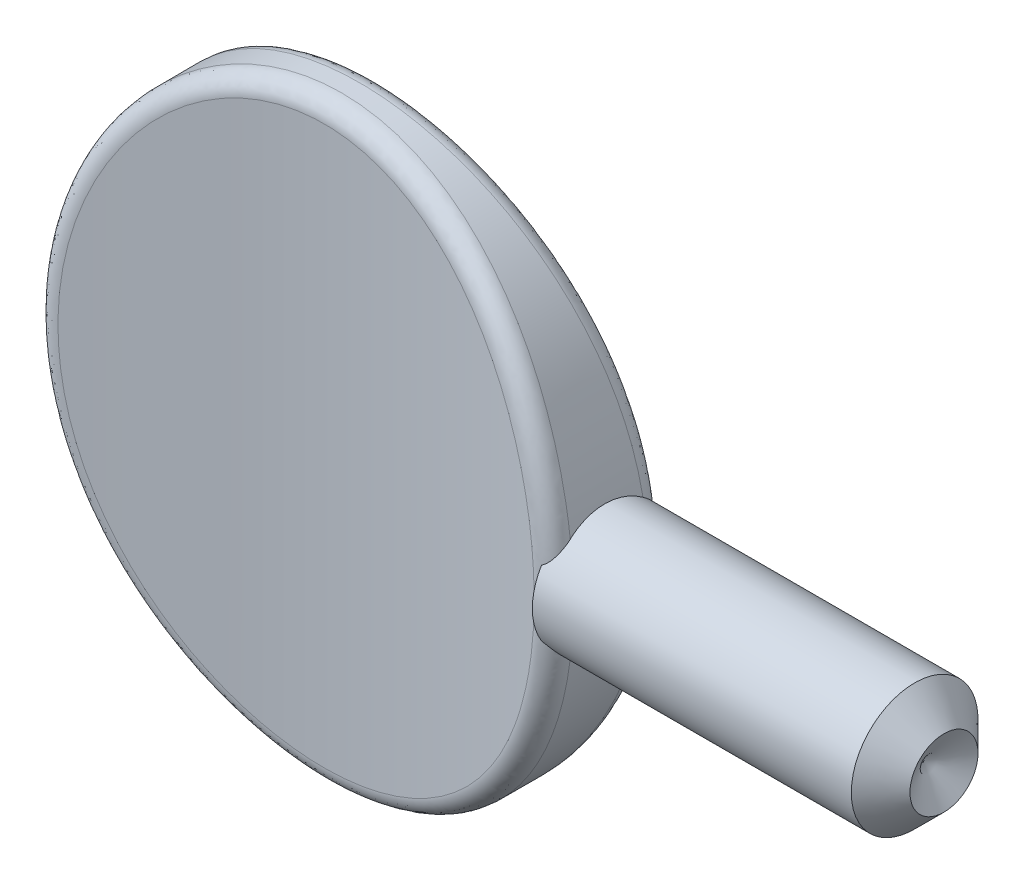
from build123d import *

# Parameters (mm, degrees)
SKETCH1_RX              = 11.303
SKETCH1_RY              = 9.906
EXTRUDE1_DEPTH          = 2.286
CUT_EXTRUDE1_DEPTH      = 16.202382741
CUT_EXTRUDE1_DEPTH_BACK = 16.202382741
SKETCH2_OUTSIDE_W       = 27.892
SKETCH2_OUTSIDE_H       = 12.652
FILLET3_R               = 0.677333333


with BuildPart() as part:
    # Sketch1 → Extrude1 (new, symmetric)
    with BuildSketch(Plane.XY):
        with Locations(Location((0, 0), (0, 0, -90))):
            Ellipse(SKETCH1_RX, SKETCH1_RY)
    extrude(amount=EXTRUDE1_DEPTH, both=True)

    # Sketch2 outside → Cut-Extrude1 (cut, two sides: drawn at the far end of the back side and taken through both)
    with BuildSketch(Plane(origin=(0, 0, 0), x_dir=(1, 0, 0), z_dir=(0, 1, 0)).offset(-CUT_EXTRUDE1_DEPTH_BACK)):
        Rectangle(SKETCH2_OUTSIDE_W, SKETCH2_OUTSIDE_H)
        with BuildLine():
            Line((-9.906, 2.286), (-9.906, -2.286))
            ThreePointArc((-9.906, -2.286), (0, -1.016), (9.906, -2.286))
            Line((9.906, -2.286), (9.906, 2.286))
            ThreePointArc((9.906, 2.286), (0, 1.016), (-9.906, 2.286))
        make_face(mode=Mode.SUBTRACT)
    extrude(amount=CUT_EXTRUDE1_DEPTH + CUT_EXTRUDE1_DEPTH_BACK, mode=Mode.SUBTRACT)

    # Fillet3
    fillet3_edges = [part.edges().sort_by_distance(p)[0] for p in [
        (-7.228513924, -7.728494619, 1.687044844),
        (3.75e-07, 11.303, -1.016),
    ]]
    fillet(fillet3_edges, radius=FILLET3_R)

    # Sketch3 → Revolve1 (revolve)
    with BuildSketch(Plane(origin=(0, 0, 0), x_dir=(1, 0, 0), z_dir=(0, 1, 0)), mode=Mode.PRIVATE) as revolve1_sk:
        with BuildLine():
            Line((21.4884, 2.413), (22.606, 1.2954))
            Line((22.606, 1.2954), (21.827645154, 0))
            Line((21.827645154, 0), (9.072182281, 0))
            Line((9.072182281, 0), (9.072182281, 2.078343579))
            ThreePointArc((9.072182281, 2.078343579), (9.262571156, 2.199720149), (9.336678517, 2.413))
            Line((9.336678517, 2.413), (13.208, 2.413))
            Line((13.208, 2.413), (21.4884, 2.413))
        make_face()
    revolve(revolve1_sk.sketch.rotate(Axis((0, 0, 0), (1, 0, 0)), 180), axis=Axis((0, 0, 0), (1, 0, 0)))


solid = part.part
